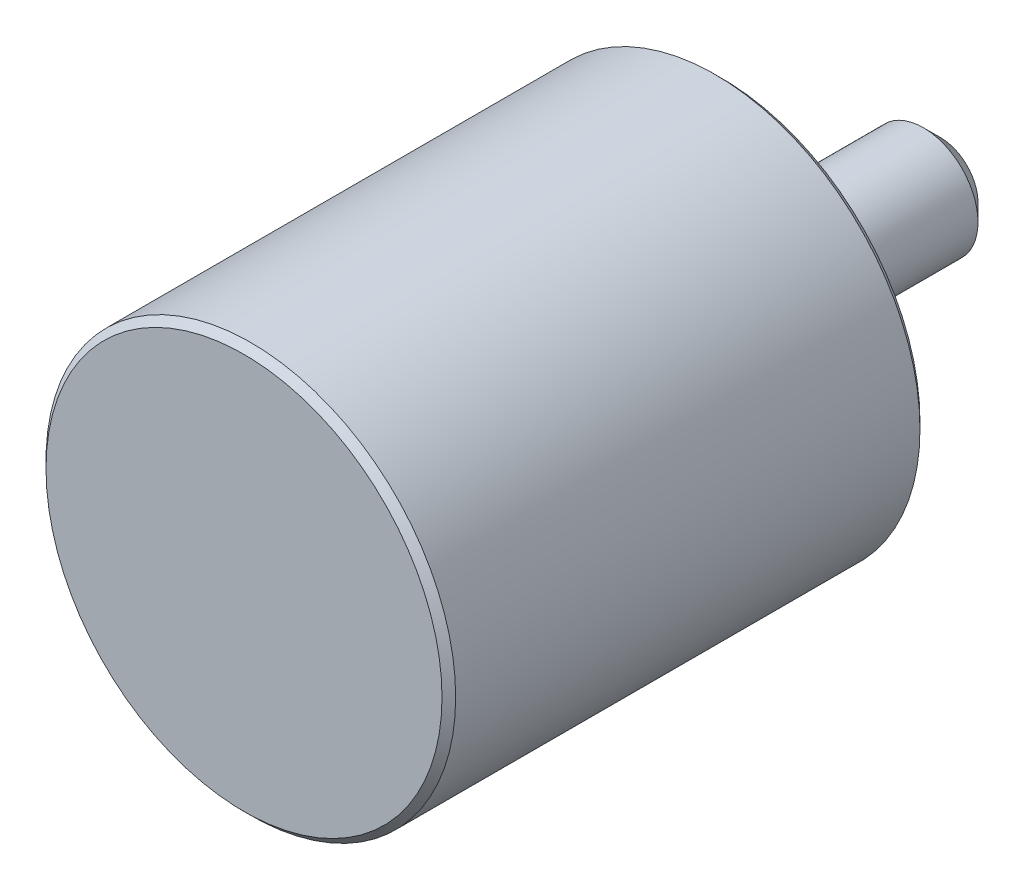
ISO-10303-21;
HEADER;
FILE_DESCRIPTION(('STEP AP214'),'2;1');
FILE_NAME('part.step','',(''),(''),'','','');
FILE_SCHEMA(('AUTOMOTIVE_DESIGN { 1 0 10303 214 1 1 1 1 }'));
ENDSEC;
DATA;
#1=APPLICATION_CONTEXT('core data for automotive mechanical design processes');
#2=APPLICATION_PROTOCOL_DEFINITION('international standard','automotive_design',2000,#1);
#3=PRODUCT_CONTEXT('',#1,'mechanical');
#4=PRODUCT('Part','Part','',(#3));
#5=PRODUCT_RELATED_PRODUCT_CATEGORY('part','',(#4));
#6=PRODUCT_DEFINITION_FORMATION('','',#4);
#7=PRODUCT_DEFINITION_CONTEXT('part definition',#1,'design');
#8=PRODUCT_DEFINITION('design','',#6,#7);
#9=PRODUCT_DEFINITION_SHAPE('','',#8);
#10=(LENGTH_UNIT() NAMED_UNIT(*) SI_UNIT(.MILLI.,.METRE.));
#11=(NAMED_UNIT(*) PLANE_ANGLE_UNIT() SI_UNIT($,.RADIAN.));
#12=(NAMED_UNIT(*) SI_UNIT($,.STERADIAN.) SOLID_ANGLE_UNIT());
#13=UNCERTAINTY_MEASURE_WITH_UNIT(LENGTH_MEASURE(1.E-05),#10,'distance_accuracy_value','');
#14=(GEOMETRIC_REPRESENTATION_CONTEXT(3) GLOBAL_UNCERTAINTY_ASSIGNED_CONTEXT((#13)) GLOBAL_UNIT_ASSIGNED_CONTEXT((#10,
#11,#12)) REPRESENTATION_CONTEXT('',''));
#15=CARTESIAN_POINT('',(0.,0.,0.));
#16=DIRECTION('',(0.,0.,1.));
#17=DIRECTION('',(1.,0.,0.));
#18=AXIS2_PLACEMENT_3D('',#15,#16,#17);
#19=CARTESIAN_POINT('',(0.,0.,0.));
#20=DIRECTION('',(0.,0.,-1.));
#21=DIRECTION('',(-1.,0.,0.));
#22=AXIS2_PLACEMENT_3D('',#19,#20,#21);
#23=PLANE('',#22);
#24=CARTESIAN_POINT('',(0.,0.,0.));
#25=DIRECTION('',(0.,0.,-1.));
#26=DIRECTION('',(-1.,0.,0.));
#27=AXIS2_PLACEMENT_3D('',#24,#25,#26);
#28=CIRCLE('',#27,5.5);
#29=CARTESIAN_POINT('',(-5.5,0.,0.));
#30=VERTEX_POINT('',#29);
#31=EDGE_CURVE('E35',#30,#30,#28,.T.);
#32=ORIENTED_EDGE('',*,*,#31,.T.);
#33=EDGE_LOOP('',(#32));
#34=FACE_BOUND('',#33,.T.);
#35=CARTESIAN_POINT('',(0.,0.,0.));
#36=DIRECTION('',(0.,0.,-1.));
#37=DIRECTION('',(-1.,0.,0.));
#38=AXIS2_PLACEMENT_3D('',#35,#36,#37);
#39=CIRCLE('',#38,4.);
#40=CARTESIAN_POINT('',(-4.,0.,0.));
#41=VERTEX_POINT('',#40);
#42=EDGE_CURVE('E47',#41,#41,#39,.T.);
#43=ORIENTED_EDGE('',*,*,#42,.F.);
#44=EDGE_LOOP('',(#43));
#45=FACE_BOUND('',#44,.T.);
#46=ADVANCED_FACE('F12',(#34,#45),#23,.T.);
#47=CARTESIAN_POINT('',(0.,0.,3.));
#48=DIRECTION('',(0.,0.,-1.));
#49=DIRECTION('',(-1.,0.,0.));
#50=AXIS2_PLACEMENT_3D('',#47,#48,#49);
#51=CYLINDRICAL_SURFACE('',#50,6.);
#52=CARTESIAN_POINT('',(0.,0.,0.499999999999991));
#53=DIRECTION('',(0.,0.,-1.));
#54=DIRECTION('',(-1.,0.,0.));
#55=AXIS2_PLACEMENT_3D('',#52,#53,#54);
#56=CIRCLE('',#55,6.);
#57=CARTESIAN_POINT('',(-6.,0.,0.500000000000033));
#58=VERTEX_POINT('',#57);
#59=EDGE_CURVE('E32',#58,#58,#56,.F.);
#60=ORIENTED_EDGE('',*,*,#59,.T.);
#61=EDGE_LOOP('',(#60));
#62=FACE_BOUND('',#61,.T.);
#63=CARTESIAN_POINT('',(0.,0.,3.));
#64=DIRECTION('',(0.,0.,1.));
#65=DIRECTION('',(1.,0.,0.));
#66=AXIS2_PLACEMENT_3D('',#63,#64,#65);
#67=CIRCLE('',#66,6.);
#68=CARTESIAN_POINT('',(6.00000000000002,0.,2.99999999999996));
#69=VERTEX_POINT('',#68);
#70=EDGE_CURVE('E44',#69,#69,#67,.F.);
#71=ORIENTED_EDGE('',*,*,#70,.T.);
#72=EDGE_LOOP('',(#71));
#73=FACE_BOUND('',#72,.T.);
#74=ADVANCED_FACE('F54',(#62,#73),#51,.T.);
#75=CARTESIAN_POINT('',(2.65352735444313E-13,0.,38.));
#76=DIRECTION('',(0.,0.,-1.));
#77=DIRECTION('',(-1.,0.,0.));
#78=AXIS2_PLACEMENT_3D('',#75,#76,#77);
#79=CYLINDRICAL_SURFACE('',#78,15.);
#80=CARTESIAN_POINT('',(0.,0.,3.5));
#81=DIRECTION('',(0.,0.,1.));
#82=DIRECTION('',(1.,0.,0.));
#83=AXIS2_PLACEMENT_3D('',#80,#81,#82);
#84=CIRCLE('',#83,15.);
#85=CARTESIAN_POINT('',(15.,0.,3.4999999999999));
#86=VERTEX_POINT('',#85);
#87=EDGE_CURVE('E23',#86,#86,#84,.T.);
#88=ORIENTED_EDGE('',*,*,#87,.T.);
#89=EDGE_LOOP('',(#88));
#90=FACE_BOUND('',#89,.T.);
#91=CARTESIAN_POINT('',(2.61861252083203E-13,0.,37.5));
#92=DIRECTION('',(0.,0.,1.));
#93=DIRECTION('',(1.,0.,0.));
#94=AXIS2_PLACEMENT_3D('',#91,#92,#93);
#95=CIRCLE('',#94,15.);
#96=CARTESIAN_POINT('',(15.0000000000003,0.,37.4999999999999));
#97=VERTEX_POINT('',#96);
#98=EDGE_CURVE('E27',#97,#97,#95,.F.);
#99=ORIENTED_EDGE('',*,*,#98,.T.);
#100=EDGE_LOOP('',(#99));
#101=FACE_BOUND('',#100,.T.);
#102=ADVANCED_FACE('F62',(#90,#101),#79,.T.);
#103=CARTESIAN_POINT('',(2.65352735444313E-13,0.,38.));
#104=DIRECTION('',(0.,0.,1.));
#105=DIRECTION('',(1.,0.,0.));
#106=AXIS2_PLACEMENT_3D('',#103,#104,#105);
#107=PLANE('',#106);
#108=CARTESIAN_POINT('',(2.65352735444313E-13,0.,38.));
#109=DIRECTION('',(0.,0.,1.));
#110=DIRECTION('',(1.,0.,0.));
#111=AXIS2_PLACEMENT_3D('',#108,#109,#110);
#112=CIRCLE('',#111,14.5);
#113=CARTESIAN_POINT('',(14.5000000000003,0.,37.9999999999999));
#114=VERTEX_POINT('',#113);
#115=EDGE_CURVE('E8',#114,#114,#112,.T.);
#116=ORIENTED_EDGE('',*,*,#115,.T.);
#117=EDGE_LOOP('',(#116));
#118=FACE_BOUND('',#117,.T.);
#119=ADVANCED_FACE('F89',(#118),#107,.T.);
#120=CARTESIAN_POINT('',(0.,0.,3.));
#121=DIRECTION('',(0.,0.,1.));
#122=DIRECTION('',(1.,0.,0.));
#123=AXIS2_PLACEMENT_3D('',#120,#121,#122);
#124=PLANE('',#123);
#125=CARTESIAN_POINT('',(0.,0.,3.));
#126=DIRECTION('',(0.,0.,1.));
#127=DIRECTION('',(1.,0.,0.));
#128=AXIS2_PLACEMENT_3D('',#125,#126,#127);
#129=CIRCLE('',#128,14.5);
#130=CARTESIAN_POINT('',(14.5,0.,2.9999999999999));
#131=VERTEX_POINT('',#130);
#132=EDGE_CURVE('E19',#131,#131,#129,.F.);
#133=ORIENTED_EDGE('',*,*,#132,.T.);
#134=EDGE_LOOP('',(#133));
#135=FACE_BOUND('',#134,.T.);
#136=ORIENTED_EDGE('',*,*,#70,.F.);
#137=EDGE_LOOP('',(#136));
#138=FACE_BOUND('',#137,.T.);
#139=ADVANCED_FACE('F96',(#135,#138),#124,.F.);
#140=CARTESIAN_POINT('',(0.,0.,-13.));
#141=DIRECTION('',(0.,0.,1.));
#142=DIRECTION('',(1.,0.,0.));
#143=AXIS2_PLACEMENT_3D('',#140,#141,#142);
#144=CYLINDRICAL_SURFACE('',#143,4.);
#145=CARTESIAN_POINT('',(0.,0.,-11.75));
#146=DIRECTION('',(0.,0.,-1.));
#147=DIRECTION('',(-1.,0.,0.));
#148=AXIS2_PLACEMENT_3D('',#145,#146,#147);
#149=CIRCLE('',#148,4.);
#150=CARTESIAN_POINT('',(-4.00000000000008,0.,-11.75));
#151=VERTEX_POINT('',#150);
#152=EDGE_CURVE('E38',#151,#151,#149,.F.);
#153=ORIENTED_EDGE('',*,*,#152,.T.);
#154=EDGE_LOOP('',(#153));
#155=FACE_BOUND('',#154,.T.);
#156=ORIENTED_EDGE('',*,*,#42,.T.);
#157=EDGE_LOOP('',(#156));
#158=FACE_BOUND('',#157,.T.);
#159=ADVANCED_FACE('F51',(#155,#158),#144,.T.);
#160=CARTESIAN_POINT('',(0.,0.,-13.));
#161=DIRECTION('',(0.,0.,-1.));
#162=DIRECTION('',(-1.,0.,0.));
#163=AXIS2_PLACEMENT_3D('',#160,#161,#162);
#164=PLANE('',#163);
#165=CARTESIAN_POINT('',(0.,0.,-13.));
#166=DIRECTION('',(0.,0.,-1.));
#167=DIRECTION('',(-1.,0.,0.));
#168=AXIS2_PLACEMENT_3D('',#165,#166,#167);
#169=CIRCLE('',#168,2.75);
#170=CARTESIAN_POINT('',(-2.75000000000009,0.,-13.));
#171=VERTEX_POINT('',#170);
#172=EDGE_CURVE('E41',#171,#171,#169,.T.);
#173=ORIENTED_EDGE('',*,*,#172,.T.);
#174=EDGE_LOOP('',(#173));
#175=FACE_BOUND('',#174,.T.);
#176=ADVANCED_FACE('F72',(#175),#164,.T.);
#177=CARTESIAN_POINT('',(0.,0.,-13.));
#178=DIRECTION('',(0.,0.,1.));
#179=DIRECTION('',(1.,0.,0.));
#180=AXIS2_PLACEMENT_3D('',#177,#178,#179);
#181=CONICAL_SURFACE('',#180,2.75,0.785398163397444);
#182=ORIENTED_EDGE('',*,*,#152,.F.);
#183=EDGE_LOOP('',(#182));
#184=FACE_BOUND('',#183,.T.);
#185=ORIENTED_EDGE('',*,*,#172,.F.);
#186=EDGE_LOOP('',(#185));
#187=FACE_BOUND('',#186,.T.);
#188=ADVANCED_FACE('F68',(#184,#187),#181,.T.);
#189=CARTESIAN_POINT('',(0.,0.,0.));
#190=DIRECTION('',(0.,0.,1.));
#191=DIRECTION('',(1.,0.,0.));
#192=AXIS2_PLACEMENT_3D('',#189,#190,#191);
#193=CONICAL_SURFACE('',#192,5.5,0.785398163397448);
#194=ORIENTED_EDGE('',*,*,#59,.F.);
#195=EDGE_LOOP('',(#194));
#196=FACE_BOUND('',#195,.T.);
#197=ORIENTED_EDGE('',*,*,#31,.F.);
#198=EDGE_LOOP('',(#197));
#199=FACE_BOUND('',#198,.T.);
#200=ADVANCED_FACE('F71',(#196,#199),#193,.T.);
#201=CARTESIAN_POINT('',(0.,0.,3.5));
#202=DIRECTION('',(0.,0.,1.));
#203=DIRECTION('',(1.,0.,0.));
#204=AXIS2_PLACEMENT_3D('',#201,#202,#203);
#205=CONICAL_SURFACE('',#204,15.,0.785398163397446);
#206=ORIENTED_EDGE('',*,*,#132,.F.);
#207=EDGE_LOOP('',(#206));
#208=FACE_BOUND('',#207,.T.);
#209=ORIENTED_EDGE('',*,*,#87,.F.);
#210=EDGE_LOOP('',(#209));
#211=FACE_BOUND('',#210,.T.);
#212=ADVANCED_FACE('F75',(#208,#211),#205,.T.);
#213=CARTESIAN_POINT('',(2.65352735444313E-13,0.,38.));
#214=DIRECTION('',(0.,0.,-1.));
#215=DIRECTION('',(-1.,0.,0.));
#216=AXIS2_PLACEMENT_3D('',#213,#214,#215);
#217=CONICAL_SURFACE('',#216,14.5,0.785398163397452);
#218=ORIENTED_EDGE('',*,*,#98,.F.);
#219=EDGE_LOOP('',(#218));
#220=FACE_BOUND('',#219,.T.);
#221=ORIENTED_EDGE('',*,*,#115,.F.);
#222=EDGE_LOOP('',(#221));
#223=FACE_BOUND('',#222,.T.);
#224=ADVANCED_FACE('F14',(#220,#223),#217,.T.);
#225=CLOSED_SHELL('',(#46,#74,#102,#119,#139,#159,#176,#188,#200,#212,#224));
#226=MANIFOLD_SOLID_BREP('B1',#225);
#227=ADVANCED_BREP_SHAPE_REPRESENTATION('',(#18,#226),#14);
#228=SHAPE_DEFINITION_REPRESENTATION(#9,#227);
ENDSEC;
END-ISO-10303-21;
